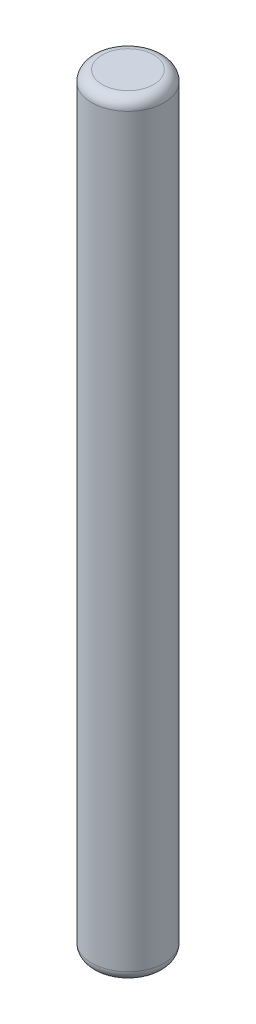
from build123d import *

# Parameters (mm, degrees)
ESQUISSE1_R        = 3.45
BOSS_EXTRU_1_DEPTH = 73
CONG_1_R           = 1


with BuildPart() as part:
    # Esquisse1 → Boss.-Extru.1 (new body)
    with BuildSketch(Plane(origin=(0, 0, 0), x_dir=(1, 0, 0), z_dir=(0, 1, 0))):
        with Locations(Location((0, 0, 0), (0, 0, 270))):
            Circle(ESQUISSE1_R)
    extrude(amount=BOSS_EXTRU_1_DEPTH)

    # Cong_1
    cong_1_edges = [part.edges().sort_by_distance(p)[0] for p in [
        (0, 0, -3.45),
        (0, 73, -3.45),
    ]]
    fillet(cong_1_edges, radius=CONG_1_R)


solid = part.part
